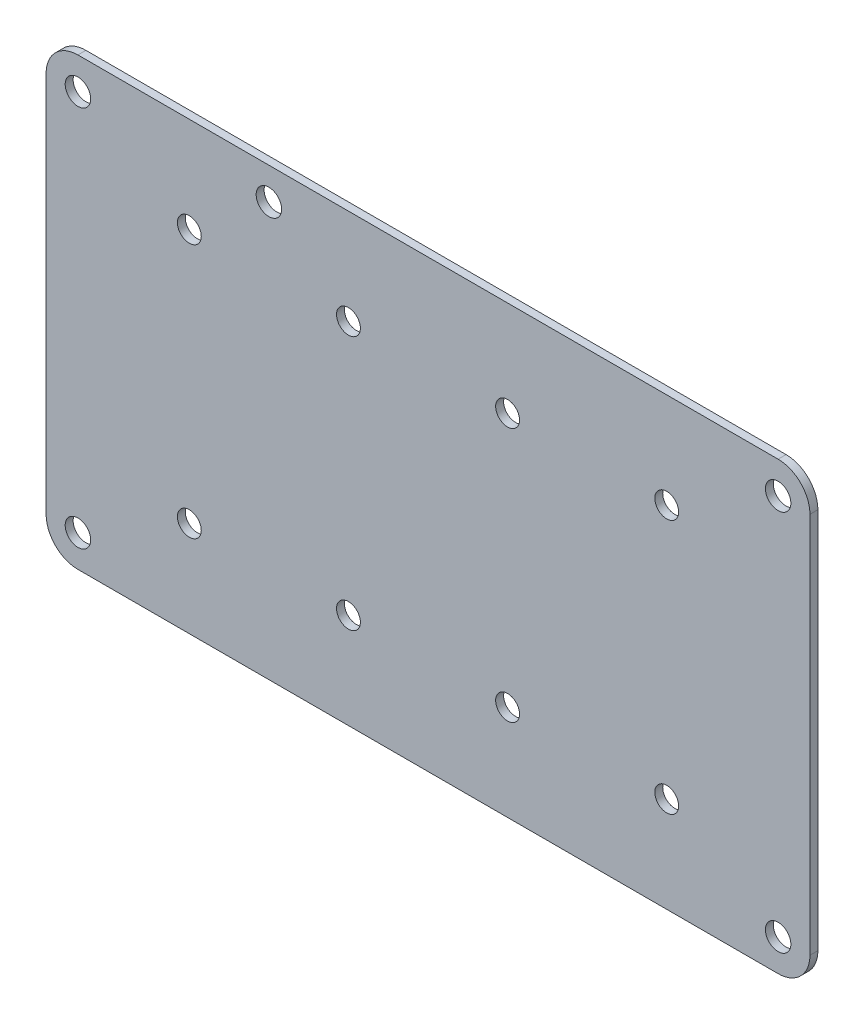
from build123d import *

# Parameters (mm, degrees)
BOSS_EXTRUDE2_DEPTH = 1.5875
SKETCH2_6_R         = 2.54
CUT_EXTRUDE5_DEPTH  = 177.441180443
FILLET2_R           = 6.35
SKETCH3_R           = 2.38125
CUT_EXTRUDE6_DEPTH  = 3.175


with BuildPart() as part:
    # Sketch2 → Boss-Extrude2 (new body)
    with BuildSketch(Plane.XY):
        Polygon((-94.698334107, 0), (0, 0), (0, -88.9), (-152.4, -88.9), (-152.4, 0), align=None)
    extrude(amount=BOSS_EXTRUDE2_DEPTH)

    # Sketch2_6 → Cut-Extrude5 (cut, through all)
    with BuildSketch(Plane.XY):
        with Locations((-107.95, -6.35)):
            Circle(SKETCH2_6_R)
        with Locations((-6.35, -6.35)):
            Circle(SKETCH2_6_R)
        with Locations((-146.05, -6.35)):
            Circle(SKETCH2_6_R)
        with Locations((-6.35, -82.55)):
            Circle(SKETCH2_6_R)
        with Locations((-146.05, -82.55)):
            Circle(SKETCH2_6_R)
    extrude(amount=CUT_EXTRUDE5_DEPTH, mode=Mode.SUBTRACT)

    # Fillet2
    fillet2_edges = [part.edges().sort_by_distance(p)[0] for p in [
        (0, 0, 0.79375),
        (0, -88.9, 0.79375),
        (-152.4, -88.9, 0.79375),
        (-152.4, 0, 0.79375),
    ]]
    fillet(fillet2_edges, radius=FILLET2_R)

    # Sketch3 → Cut-Extrude6 (cut)
    with BuildSketch(Plane(origin=(0, 0, 0), x_dir=(-1, 0, 0), z_dir=(0, 0, -1))):
        with Locations((123.825, -69.85)):
            Circle(SKETCH3_R)
        with Locations((92.075, -69.85)):
            Circle(SKETCH3_R)
        with Locations((60.325, -69.85)):
            Circle(SKETCH3_R)
        with Locations((28.575, -69.85)):
            Circle(SKETCH3_R)
        with Locations((28.575, -19.05)):
            Circle(SKETCH3_R)
        with Locations((60.325, -19.05)):
            Circle(SKETCH3_R)
        with Locations((92.075, -19.05)):
            Circle(SKETCH3_R)
        with Locations((123.825, -19.05)):
            Circle(SKETCH3_R)
    extrude(amount=-CUT_EXTRUDE6_DEPTH, mode=Mode.SUBTRACT)


solid = part.part
